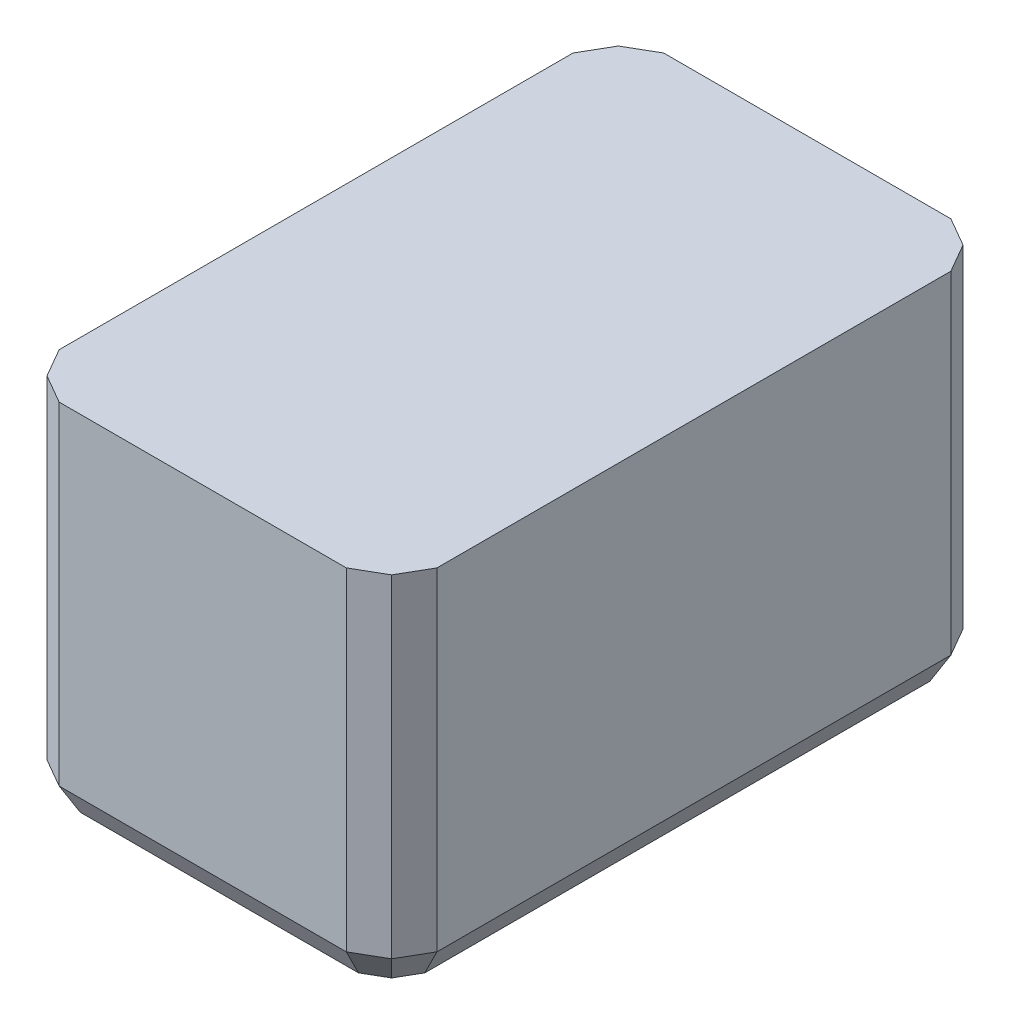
ISO-10303-21;
HEADER;
FILE_DESCRIPTION(('STEP AP214'),'2;1');
FILE_NAME('part.step','',(''),(''),'','','');
FILE_SCHEMA(('AUTOMOTIVE_DESIGN { 1 0 10303 214 1 1 1 1 }'));
ENDSEC;
DATA;
#1=APPLICATION_CONTEXT('core data for automotive mechanical design processes');
#2=APPLICATION_PROTOCOL_DEFINITION('international standard','automotive_design',2000,#1);
#3=PRODUCT_CONTEXT('',#1,'mechanical');
#4=PRODUCT('Part','Part','',(#3));
#5=PRODUCT_RELATED_PRODUCT_CATEGORY('part','',(#4));
#6=PRODUCT_DEFINITION_FORMATION('','',#4);
#7=PRODUCT_DEFINITION_CONTEXT('part definition',#1,'design');
#8=PRODUCT_DEFINITION('design','',#6,#7);
#9=PRODUCT_DEFINITION_SHAPE('','',#8);
#10=(LENGTH_UNIT() NAMED_UNIT(*) SI_UNIT(.MILLI.,.METRE.));
#11=(NAMED_UNIT(*) PLANE_ANGLE_UNIT() SI_UNIT($,.RADIAN.));
#12=(NAMED_UNIT(*) SI_UNIT($,.STERADIAN.) SOLID_ANGLE_UNIT());
#13=UNCERTAINTY_MEASURE_WITH_UNIT(LENGTH_MEASURE(1.E-05),#10,'distance_accuracy_value','');
#14=(GEOMETRIC_REPRESENTATION_CONTEXT(3) GLOBAL_UNCERTAINTY_ASSIGNED_CONTEXT((#13)) GLOBAL_UNIT_ASSIGNED_CONTEXT((#10,
#11,#12)) REPRESENTATION_CONTEXT('',''));
#15=CARTESIAN_POINT('',(0.,0.,0.));
#16=DIRECTION('',(0.,0.,1.));
#17=DIRECTION('',(1.,0.,0.));
#18=AXIS2_PLACEMENT_3D('',#15,#16,#17);
#19=CARTESIAN_POINT('',(-228.038475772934,500.,-378.038475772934));
#20=DIRECTION('',(0.866025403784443,0.,0.499999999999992));
#21=DIRECTION('',(0.499999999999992,0.,-0.866025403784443));
#22=AXIS2_PLACEMENT_3D('',#19,#20,#21);
#23=PLANE('',#22);
#24=DIRECTION('',(0.499999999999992,0.,-0.866025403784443));
#25=VECTOR('',#24,1.);
#26=CARTESIAN_POINT('',(-250.,60.0000000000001,-340.));
#27=LINE('',#26,#25);
#28=CARTESIAN_POINT('',(-250.,60.0000000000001,-340.));
#29=VERTEX_POINT('',#28);
#30=CARTESIAN_POINT('',(-228.038475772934,60.0000000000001,-378.038475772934));
#31=VERTEX_POINT('',#30);
#32=EDGE_CURVE('E308',#29,#31,#27,.T.);
#33=ORIENTED_EDGE('',*,*,#32,.F.);
#34=DIRECTION('',(0.,-1.,0.));
#35=VECTOR('',#34,1.);
#36=CARTESIAN_POINT('',(-250.,500.,-340.));
#37=LINE('',#36,#35);
#38=CARTESIAN_POINT('',(-250.,500.,-340.));
#39=VERTEX_POINT('',#38);
#40=EDGE_CURVE('E12',#39,#29,#37,.T.);
#41=ORIENTED_EDGE('',*,*,#40,.F.);
#42=DIRECTION('',(-0.499999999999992,0.,0.866025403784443));
#43=VECTOR('',#42,1.);
#44=CARTESIAN_POINT('',(-228.038475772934,500.,-378.038475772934));
#45=LINE('',#44,#43);
#46=CARTESIAN_POINT('',(-228.038475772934,500.,-378.038475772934));
#47=VERTEX_POINT('',#46);
#48=EDGE_CURVE('E636',#47,#39,#45,.T.);
#49=ORIENTED_EDGE('',*,*,#48,.F.);
#50=DIRECTION('',(0.,-1.,0.));
#51=VECTOR('',#50,1.);
#52=CARTESIAN_POINT('',(-228.038475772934,500.,-378.038475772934));
#53=LINE('',#52,#51);
#54=EDGE_CURVE('E491',#47,#31,#53,.T.);
#55=ORIENTED_EDGE('',*,*,#54,.T.);
#56=EDGE_LOOP('',(#33,#41,#49,#55));
#57=FACE_BOUND('',#56,.T.);
#58=ADVANCED_FACE('F42',(#57),#23,.F.);
#59=CARTESIAN_POINT('',(-250.,500.,340.));
#60=DIRECTION('',(0.866025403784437,0.,-0.500000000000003));
#61=DIRECTION('',(-0.500000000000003,0.,-0.866025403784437));
#62=AXIS2_PLACEMENT_3D('',#59,#60,#61);
#63=PLANE('',#62);
#64=DIRECTION('',(-0.500000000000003,0.,-0.866025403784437));
#65=VECTOR('',#64,1.);
#66=CARTESIAN_POINT('',(-228.038475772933,60.0000000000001,378.038475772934));
#67=LINE('',#66,#65);
#68=CARTESIAN_POINT('',(-228.038475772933,60.0000000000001,378.038475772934));
#69=VERTEX_POINT('',#68);
#70=CARTESIAN_POINT('',(-250.,60.0000000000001,340.));
#71=VERTEX_POINT('',#70);
#72=EDGE_CURVE('E278',#69,#71,#67,.T.);
#73=ORIENTED_EDGE('',*,*,#72,.F.);
#74=DIRECTION('',(0.,-1.,0.));
#75=VECTOR('',#74,1.);
#76=CARTESIAN_POINT('',(-228.038475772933,500.,378.038475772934));
#77=LINE('',#76,#75);
#78=CARTESIAN_POINT('',(-228.038475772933,500.,378.038475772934));
#79=VERTEX_POINT('',#78);
#80=EDGE_CURVE('E267',#79,#69,#77,.T.);
#81=ORIENTED_EDGE('',*,*,#80,.F.);
#82=DIRECTION('',(0.500000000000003,0.,0.866025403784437));
#83=VECTOR('',#82,1.);
#84=CARTESIAN_POINT('',(-250.,500.,340.));
#85=LINE('',#84,#83);
#86=CARTESIAN_POINT('',(-250.,500.,340.));
#87=VERTEX_POINT('',#86);
#88=EDGE_CURVE('E279',#87,#79,#85,.T.);
#89=ORIENTED_EDGE('',*,*,#88,.F.);
#90=DIRECTION('',(0.,-1.,0.));
#91=VECTOR('',#90,1.);
#92=CARTESIAN_POINT('',(-250.,500.,340.));
#93=LINE('',#92,#91);
#94=EDGE_CURVE('E51',#87,#71,#93,.T.);
#95=ORIENTED_EDGE('',*,*,#94,.T.);
#96=EDGE_LOOP('',(#73,#81,#89,#95));
#97=FACE_BOUND('',#96,.T.);
#98=ADVANCED_FACE('F275',(#97),#63,.F.);
#99=CARTESIAN_POINT('',(-190.,500.,400.));
#100=DIRECTION('',(0.,0.,-1.));
#101=DIRECTION('',(-1.,0.,0.));
#102=AXIS2_PLACEMENT_3D('',#99,#100,#101);
#103=PLANE('',#102);
#104=DIRECTION('',(-1.,0.,0.));
#105=VECTOR('',#104,1.);
#106=CARTESIAN_POINT('',(190.,60.0000000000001,400.));
#107=LINE('',#106,#105);
#108=CARTESIAN_POINT('',(190.,60.0000000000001,400.));
#109=VERTEX_POINT('',#108);
#110=CARTESIAN_POINT('',(-190.,60.0000000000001,400.));
#111=VERTEX_POINT('',#110);
#112=EDGE_CURVE('E573',#109,#111,#107,.T.);
#113=ORIENTED_EDGE('',*,*,#112,.F.);
#114=DIRECTION('',(0.,-1.,0.));
#115=VECTOR('',#114,1.);
#116=CARTESIAN_POINT('',(190.,500.,400.));
#117=LINE('',#116,#115);
#118=CARTESIAN_POINT('',(190.,500.,400.));
#119=VERTEX_POINT('',#118);
#120=EDGE_CURVE('E261',#119,#109,#117,.T.);
#121=ORIENTED_EDGE('',*,*,#120,.F.);
#122=DIRECTION('',(1.,0.,0.));
#123=VECTOR('',#122,1.);
#124=CARTESIAN_POINT('',(-190.,500.,400.));
#125=LINE('',#124,#123);
#126=CARTESIAN_POINT('',(-190.,500.,400.));
#127=VERTEX_POINT('',#126);
#128=EDGE_CURVE('E627',#127,#119,#125,.T.);
#129=ORIENTED_EDGE('',*,*,#128,.F.);
#130=DIRECTION('',(0.,-1.,0.));
#131=VECTOR('',#130,1.);
#132=CARTESIAN_POINT('',(-190.,500.,400.));
#133=LINE('',#132,#131);
#134=EDGE_CURVE('E264',#127,#111,#133,.T.);
#135=ORIENTED_EDGE('',*,*,#134,.T.);
#136=EDGE_LOOP('',(#113,#121,#129,#135));
#137=FACE_BOUND('',#136,.T.);
#138=ADVANCED_FACE('F486',(#137),#103,.F.);
#139=CARTESIAN_POINT('',(228.038475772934,500.,378.038475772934));
#140=DIRECTION('',(-0.866025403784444,0.,-0.49999999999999));
#141=DIRECTION('',(-0.49999999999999,0.,0.866025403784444));
#142=AXIS2_PLACEMENT_3D('',#139,#140,#141);
#143=PLANE('',#142);
#144=DIRECTION('',(-0.49999999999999,0.,0.866025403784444));
#145=VECTOR('',#144,1.);
#146=CARTESIAN_POINT('',(250.,60.0000000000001,340.));
#147=LINE('',#146,#145);
#148=CARTESIAN_POINT('',(250.,60.0000000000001,340.));
#149=VERTEX_POINT('',#148);
#150=CARTESIAN_POINT('',(228.038475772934,60.0000000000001,378.038475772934));
#151=VERTEX_POINT('',#150);
#152=EDGE_CURVE('E550',#149,#151,#147,.T.);
#153=ORIENTED_EDGE('',*,*,#152,.F.);
#154=DIRECTION('',(0.,-1.,0.));
#155=VECTOR('',#154,1.);
#156=CARTESIAN_POINT('',(250.,500.,340.));
#157=LINE('',#156,#155);
#158=CARTESIAN_POINT('',(250.,500.,340.));
#159=VERTEX_POINT('',#158);
#160=EDGE_CURVE('E240',#159,#149,#157,.T.);
#161=ORIENTED_EDGE('',*,*,#160,.F.);
#162=DIRECTION('',(0.49999999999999,0.,-0.866025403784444));
#163=VECTOR('',#162,1.);
#164=CARTESIAN_POINT('',(228.038475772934,500.,378.038475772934));
#165=LINE('',#164,#163);
#166=CARTESIAN_POINT('',(228.038475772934,500.,378.038475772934));
#167=VERTEX_POINT('',#166);
#168=EDGE_CURVE('E621',#167,#159,#165,.T.);
#169=ORIENTED_EDGE('',*,*,#168,.F.);
#170=DIRECTION('',(0.,-1.,0.));
#171=VECTOR('',#170,1.);
#172=CARTESIAN_POINT('',(228.038475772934,500.,378.038475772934));
#173=LINE('',#172,#171);
#174=EDGE_CURVE('E246',#167,#151,#173,.T.);
#175=ORIENTED_EDGE('',*,*,#174,.T.);
#176=EDGE_LOOP('',(#153,#161,#169,#175));
#177=FACE_BOUND('',#176,.T.);
#178=ADVANCED_FACE('F620',(#177),#143,.F.);
#179=CARTESIAN_POINT('',(250.,500.,-340.));
#180=DIRECTION('',(-0.866025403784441,0.,0.499999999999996));
#181=DIRECTION('',(0.499999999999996,0.,0.866025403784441));
#182=AXIS2_PLACEMENT_3D('',#179,#180,#181);
#183=PLANE('',#182);
#184=DIRECTION('',(0.499999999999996,0.,0.866025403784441));
#185=VECTOR('',#184,1.);
#186=CARTESIAN_POINT('',(228.038475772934,60.,-378.038475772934));
#187=LINE('',#186,#185);
#188=CARTESIAN_POINT('',(228.038475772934,60.,-378.038475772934));
#189=VERTEX_POINT('',#188);
#190=CARTESIAN_POINT('',(250.,60.0000000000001,-340.));
#191=VERTEX_POINT('',#190);
#192=EDGE_CURVE('E223',#189,#191,#187,.T.);
#193=ORIENTED_EDGE('',*,*,#192,.F.);
#194=DIRECTION('',(0.,-1.,0.));
#195=VECTOR('',#194,1.);
#196=CARTESIAN_POINT('',(228.038475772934,500.,-378.038475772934));
#197=LINE('',#196,#195);
#198=CARTESIAN_POINT('',(228.038475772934,500.,-378.038475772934));
#199=VERTEX_POINT('',#198);
#200=EDGE_CURVE('E245',#199,#189,#197,.T.);
#201=ORIENTED_EDGE('',*,*,#200,.F.);
#202=DIRECTION('',(-0.499999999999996,0.,-0.866025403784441));
#203=VECTOR('',#202,1.);
#204=CARTESIAN_POINT('',(250.,500.,-340.));
#205=LINE('',#204,#203);
#206=CARTESIAN_POINT('',(250.,500.,-340.));
#207=VERTEX_POINT('',#206);
#208=EDGE_CURVE('E244',#207,#199,#205,.T.);
#209=ORIENTED_EDGE('',*,*,#208,.F.);
#210=DIRECTION('',(0.,-1.,0.));
#211=VECTOR('',#210,1.);
#212=CARTESIAN_POINT('',(250.,500.,-340.));
#213=LINE('',#212,#211);
#214=EDGE_CURVE('E45',#207,#191,#213,.T.);
#215=ORIENTED_EDGE('',*,*,#214,.T.);
#216=EDGE_LOOP('',(#193,#201,#209,#215));
#217=FACE_BOUND('',#216,.T.);
#218=ADVANCED_FACE('F243',(#217),#183,.F.);
#219=CARTESIAN_POINT('',(190.,500.,-400.));
#220=DIRECTION('',(0.,0.,1.));
#221=DIRECTION('',(1.,0.,0.));
#222=AXIS2_PLACEMENT_3D('',#219,#220,#221);
#223=PLANE('',#222);
#224=DIRECTION('',(1.,0.,0.));
#225=VECTOR('',#224,1.);
#226=CARTESIAN_POINT('',(-190.,60.,-400.));
#227=LINE('',#226,#225);
#228=CARTESIAN_POINT('',(-190.,60.,-400.));
#229=VERTEX_POINT('',#228);
#230=CARTESIAN_POINT('',(190.,60.,-400.));
#231=VERTEX_POINT('',#230);
#232=EDGE_CURVE('E324',#229,#231,#227,.T.);
#233=ORIENTED_EDGE('',*,*,#232,.F.);
#234=DIRECTION('',(0.,-1.,0.));
#235=VECTOR('',#234,1.);
#236=CARTESIAN_POINT('',(-190.,500.,-400.));
#237=LINE('',#236,#235);
#238=CARTESIAN_POINT('',(-190.,500.,-400.));
#239=VERTEX_POINT('',#238);
#240=EDGE_CURVE('E254',#239,#229,#237,.T.);
#241=ORIENTED_EDGE('',*,*,#240,.F.);
#242=DIRECTION('',(-1.,0.,0.));
#243=VECTOR('',#242,1.);
#244=CARTESIAN_POINT('',(190.,500.,-400.));
#245=LINE('',#244,#243);
#246=CARTESIAN_POINT('',(190.,500.,-400.));
#247=VERTEX_POINT('',#246);
#248=EDGE_CURVE('E507',#247,#239,#245,.T.);
#249=ORIENTED_EDGE('',*,*,#248,.F.);
#250=DIRECTION('',(0.,-1.,0.));
#251=VECTOR('',#250,1.);
#252=CARTESIAN_POINT('',(190.,500.,-400.));
#253=LINE('',#252,#251);
#254=EDGE_CURVE('E248',#247,#231,#253,.T.);
#255=ORIENTED_EDGE('',*,*,#254,.T.);
#256=EDGE_LOOP('',(#233,#241,#249,#255));
#257=FACE_BOUND('',#256,.T.);
#258=ADVANCED_FACE('F504',(#257),#223,.F.);
#259=CARTESIAN_POINT('',(-250.,500.,-340.));
#260=DIRECTION('',(1.,0.,0.));
#261=DIRECTION('',(0.,0.,-1.));
#262=AXIS2_PLACEMENT_3D('',#259,#260,#261);
#263=PLANE('',#262);
#264=ORIENTED_EDGE('',*,*,#40,.T.);
#265=DIRECTION('',(0.,0.,-1.));
#266=VECTOR('',#265,1.);
#267=CARTESIAN_POINT('',(-250.,60.0000000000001,340.));
#268=LINE('',#267,#266);
#269=EDGE_CURVE('E286',#71,#29,#268,.T.);
#270=ORIENTED_EDGE('',*,*,#269,.F.);
#271=ORIENTED_EDGE('',*,*,#94,.F.);
#272=DIRECTION('',(0.,0.,1.));
#273=VECTOR('',#272,1.);
#274=CARTESIAN_POINT('',(-250.,500.,-340.));
#275=LINE('',#274,#273);
#276=EDGE_CURVE('E283',#39,#87,#275,.T.);
#277=ORIENTED_EDGE('',*,*,#276,.F.);
#278=EDGE_LOOP('',(#264,#270,#271,#277));
#279=FACE_BOUND('',#278,.T.);
#280=ADVANCED_FACE('F282',(#279),#263,.F.);
#281=CARTESIAN_POINT('',(-228.038475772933,500.,378.038475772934));
#282=DIRECTION('',(0.499999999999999,0.,-0.866025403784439));
#283=DIRECTION('',(-0.866025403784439,0.,-0.499999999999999));
#284=AXIS2_PLACEMENT_3D('',#281,#282,#283);
#285=PLANE('',#284);
#286=ORIENTED_EDGE('',*,*,#80,.T.);
#287=DIRECTION('',(-0.866025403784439,0.,-0.499999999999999));
#288=VECTOR('',#287,1.);
#289=CARTESIAN_POINT('',(-190.,60.0000000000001,400.));
#290=LINE('',#289,#288);
#291=EDGE_CURVE('E580',#111,#69,#290,.T.);
#292=ORIENTED_EDGE('',*,*,#291,.F.);
#293=ORIENTED_EDGE('',*,*,#134,.F.);
#294=DIRECTION('',(0.866025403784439,0.,0.499999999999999));
#295=VECTOR('',#294,1.);
#296=CARTESIAN_POINT('',(-228.038475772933,500.,378.038475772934));
#297=LINE('',#296,#295);
#298=EDGE_CURVE('E643',#79,#127,#297,.T.);
#299=ORIENTED_EDGE('',*,*,#298,.F.);
#300=EDGE_LOOP('',(#286,#292,#293,#299));
#301=FACE_BOUND('',#300,.T.);
#302=ADVANCED_FACE('F649',(#301),#285,.F.);
#303=CARTESIAN_POINT('',(190.,500.,400.));
#304=DIRECTION('',(-0.499999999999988,0.,-0.866025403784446));
#305=DIRECTION('',(-0.866025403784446,0.,0.499999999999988));
#306=AXIS2_PLACEMENT_3D('',#303,#304,#305);
#307=PLANE('',#306);
#308=ORIENTED_EDGE('',*,*,#120,.T.);
#309=DIRECTION('',(-0.866025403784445,0.,0.499999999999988));
#310=VECTOR('',#309,1.);
#311=CARTESIAN_POINT('',(228.038475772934,60.0000000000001,378.038475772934));
#312=LINE('',#311,#310);
#313=EDGE_CURVE('E561',#151,#109,#312,.T.);
#314=ORIENTED_EDGE('',*,*,#313,.F.);
#315=ORIENTED_EDGE('',*,*,#174,.F.);
#316=DIRECTION('',(0.866025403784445,0.,-0.499999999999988));
#317=VECTOR('',#316,1.);
#318=CARTESIAN_POINT('',(190.,500.,400.));
#319=LINE('',#318,#317);
#320=EDGE_CURVE('E624',#119,#167,#319,.T.);
#321=ORIENTED_EDGE('',*,*,#320,.F.);
#322=EDGE_LOOP('',(#308,#314,#315,#321));
#323=FACE_BOUND('',#322,.T.);
#324=ADVANCED_FACE('F616',(#323),#307,.F.);
#325=CARTESIAN_POINT('',(250.,500.,340.));
#326=DIRECTION('',(-1.,0.,0.));
#327=DIRECTION('',(0.,0.,1.));
#328=AXIS2_PLACEMENT_3D('',#325,#326,#327);
#329=PLANE('',#328);
#330=ORIENTED_EDGE('',*,*,#160,.T.);
#331=DIRECTION('',(0.,0.,-1.));
#332=VECTOR('',#331,1.);
#333=CARTESIAN_POINT('',(250.,60.0000000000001,509.705627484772));
#334=LINE('',#333,#332);
#335=EDGE_CURVE('E212',#149,#191,#334,.T.);
#336=ORIENTED_EDGE('',*,*,#335,.T.);
#337=ORIENTED_EDGE('',*,*,#214,.F.);
#338=DIRECTION('',(0.,0.,-1.));
#339=VECTOR('',#338,1.);
#340=CARTESIAN_POINT('',(250.,500.,340.));
#341=LINE('',#340,#339);
#342=EDGE_CURVE('E623',#159,#207,#341,.T.);
#343=ORIENTED_EDGE('',*,*,#342,.F.);
#344=EDGE_LOOP('',(#330,#336,#337,#343));
#345=FACE_BOUND('',#344,.T.);
#346=ADVANCED_FACE('F236',(#345),#329,.F.);
#347=CARTESIAN_POINT('',(228.038475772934,500.,-378.038475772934));
#348=DIRECTION('',(-0.499999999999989,0.,0.866025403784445));
#349=DIRECTION('',(0.866025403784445,0.,0.499999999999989));
#350=AXIS2_PLACEMENT_3D('',#347,#348,#349);
#351=PLANE('',#350);
#352=ORIENTED_EDGE('',*,*,#200,.T.);
#353=DIRECTION('',(0.866025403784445,0.,0.499999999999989));
#354=VECTOR('',#353,1.);
#355=CARTESIAN_POINT('',(190.,60.,-400.));
#356=LINE('',#355,#354);
#357=EDGE_CURVE('E337',#231,#189,#356,.T.);
#358=ORIENTED_EDGE('',*,*,#357,.F.);
#359=ORIENTED_EDGE('',*,*,#254,.F.);
#360=DIRECTION('',(-0.866025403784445,0.,-0.499999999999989));
#361=VECTOR('',#360,1.);
#362=CARTESIAN_POINT('',(228.038475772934,500.,-378.038475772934));
#363=LINE('',#362,#361);
#364=EDGE_CURVE('E509',#199,#247,#363,.T.);
#365=ORIENTED_EDGE('',*,*,#364,.F.);
#366=EDGE_LOOP('',(#352,#358,#359,#365));
#367=FACE_BOUND('',#366,.T.);
#368=ADVANCED_FACE('F508',(#367),#351,.F.);
#369=CARTESIAN_POINT('',(-190.,500.,-400.));
#370=DIRECTION('',(0.499999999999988,0.,0.866025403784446));
#371=DIRECTION('',(0.866025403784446,0.,-0.499999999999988));
#372=AXIS2_PLACEMENT_3D('',#369,#370,#371);
#373=PLANE('',#372);
#374=ORIENTED_EDGE('',*,*,#240,.T.);
#375=DIRECTION('',(0.866025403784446,0.,-0.499999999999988));
#376=VECTOR('',#375,1.);
#377=CARTESIAN_POINT('',(-228.038475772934,60.,-378.038475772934));
#378=LINE('',#377,#376);
#379=EDGE_CURVE('E318',#31,#229,#378,.T.);
#380=ORIENTED_EDGE('',*,*,#379,.F.);
#381=ORIENTED_EDGE('',*,*,#54,.F.);
#382=DIRECTION('',(-0.866025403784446,0.,0.499999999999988));
#383=VECTOR('',#382,1.);
#384=CARTESIAN_POINT('',(-190.,500.,-400.));
#385=LINE('',#384,#383);
#386=EDGE_CURVE('E634',#239,#47,#385,.T.);
#387=ORIENTED_EDGE('',*,*,#386,.F.);
#388=EDGE_LOOP('',(#374,#380,#381,#387));
#389=FACE_BOUND('',#388,.T.);
#390=ADVANCED_FACE('F496',(#389),#373,.F.);
#391=CARTESIAN_POINT('',(-114.019237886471,500.,-575.525588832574));
#392=DIRECTION('',(0.,-1.,0.));
#393=DIRECTION('',(0.,0.,-1.));
#394=AXIS2_PLACEMENT_3D('',#391,#392,#393);
#395=PLANE('',#394);
#396=ORIENTED_EDGE('',*,*,#48,.T.);
#397=ORIENTED_EDGE('',*,*,#276,.T.);
#398=ORIENTED_EDGE('',*,*,#88,.T.);
#399=ORIENTED_EDGE('',*,*,#298,.T.);
#400=ORIENTED_EDGE('',*,*,#128,.T.);
#401=ORIENTED_EDGE('',*,*,#320,.T.);
#402=ORIENTED_EDGE('',*,*,#168,.T.);
#403=ORIENTED_EDGE('',*,*,#342,.T.);
#404=ORIENTED_EDGE('',*,*,#208,.T.);
#405=ORIENTED_EDGE('',*,*,#364,.T.);
#406=ORIENTED_EDGE('',*,*,#248,.T.);
#407=ORIENTED_EDGE('',*,*,#386,.T.);
#408=EDGE_LOOP('',(#396,#397,#398,#399,#400,#401,#402,#403,#404,#405,#406,#407));
#409=FACE_BOUND('',#408,.T.);
#410=ADVANCED_FACE('F366',(#409),#395,.F.);
#411=CARTESIAN_POINT('',(69.4520422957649,-90.4321606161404,-219.452042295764));
#412=DIRECTION('',(0.433012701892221,-0.866025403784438,-0.249999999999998));
#413=DIRECTION('',(0.894427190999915,0.44721359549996,0.));
#414=AXIS2_PLACEMENT_3D('',#411,#412,#413);
#415=PLANE('',#414);
#416=CARTESIAN_POINT('',(228.038475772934,21.9615242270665,-334.115427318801));
#417=DIRECTION('',(-0.843610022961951,-0.48705847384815,0.226044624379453));
#418=VECTOR('',#417,1.);
#419=LINE('',#416,#418);
#420=CARTESIAN_POINT('',(228.038475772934,21.9615242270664,-334.115427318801));
#421=VERTEX_POINT('',#420);
#422=CARTESIAN_POINT('',(190.,0.,-323.923048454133));
#423=VERTEX_POINT('',#422);
#424=EDGE_CURVE('E217',#421,#423,#419,.T.);
#425=ORIENTED_EDGE('',*,*,#424,.T.);
#426=DIRECTION('',(0.499999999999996,0.,0.866025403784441));
#427=VECTOR('',#426,1.);
#428=CARTESIAN_POINT('',(184.115427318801,0.,-334.115427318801));
#429=LINE('',#428,#427);
#430=CARTESIAN_POINT('',(184.115427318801,0.,-334.115427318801));
#431=VERTEX_POINT('',#430);
#432=EDGE_CURVE('E218',#431,#423,#429,.T.);
#433=ORIENTED_EDGE('',*,*,#432,.F.);
#434=DIRECTION('',(0.617565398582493,0.487058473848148,-0.617565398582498));
#435=VECTOR('',#434,1.);
#436=CARTESIAN_POINT('',(69.4520422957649,-90.4321606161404,-219.452042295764));
#437=LINE('',#436,#435);
#438=CARTESIAN_POINT('',(211.961524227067,21.9615242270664,-361.961524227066));
#439=VERTEX_POINT('',#438);
#440=EDGE_CURVE('E345',#431,#439,#437,.T.);
#441=ORIENTED_EDGE('',*,*,#440,.T.);
#442=DIRECTION('',(0.499999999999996,0.,0.866025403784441));
#443=VECTOR('',#442,1.);
#444=CARTESIAN_POINT('',(211.961524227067,21.9615242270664,-361.961524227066));
#445=LINE('',#444,#443);
#446=EDGE_CURVE('E231',#439,#421,#445,.T.);
#447=ORIENTED_EDGE('',*,*,#446,.T.);
#448=EDGE_LOOP('',(#425,#433,#441,#447));
#449=FACE_BOUND('',#448,.T.);
#450=ADVANCED_FACE('F356',(#449),#415,.T.);
#451=CARTESIAN_POINT('',(160.895149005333,-98.8628168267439,-310.895149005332));
#452=DIRECTION('',(0.750000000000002,-0.500000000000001,-0.433012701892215));
#453=DIRECTION('',(0.554700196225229,0.832050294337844,0.));
#454=AXIS2_PLACEMENT_3D('',#451,#452,#453);
#455=PLANE('',#454);
#456=CARTESIAN_POINT('',(250.,60.,-340.));
#457=DIRECTION('',(-0.495572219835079,-0.858356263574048,0.132788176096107));
#458=VECTOR('',#457,1.);
#459=LINE('',#456,#458);
#460=EDGE_CURVE('E206',#191,#421,#459,.T.);
#461=ORIENTED_EDGE('',*,*,#460,.T.);
#462=ORIENTED_EDGE('',*,*,#446,.F.);
#463=DIRECTION('',(0.36278404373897,0.858356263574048,-0.362784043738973));
#464=VECTOR('',#463,1.);
#465=CARTESIAN_POINT('',(160.895149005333,-98.8628168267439,-310.895149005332));
#466=LINE('',#465,#464);
#467=EDGE_CURVE('E226',#439,#189,#466,.T.);
#468=ORIENTED_EDGE('',*,*,#467,.T.);
#469=ORIENTED_EDGE('',*,*,#192,.T.);
#470=EDGE_LOOP('',(#461,#462,#468,#469));
#471=FACE_BOUND('',#470,.T.);
#472=ADVANCED_FACE('F224',(#471),#455,.T.);
#473=CARTESIAN_POINT('',(165.328259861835,-99.4806352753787,-307.923812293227));
#474=DIRECTION('',(-0.43301270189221,0.500000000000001,0.750000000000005));
#475=DIRECTION('',(0.,-0.832050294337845,0.554700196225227));
#476=AXIS2_PLACEMENT_3D('',#473,#474,#475);
#477=PLANE('',#476);
#478=DIRECTION('',(0.866025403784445,0.,0.499999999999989));
#479=VECTOR('',#478,1.);
#480=CARTESIAN_POINT('',(184.115427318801,21.9615242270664,-378.038475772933));
#481=LINE('',#480,#479);
#482=CARTESIAN_POINT('',(184.115427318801,21.9615242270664,-378.038475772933));
#483=VERTEX_POINT('',#482);
#484=EDGE_CURVE('E342',#483,#439,#481,.T.);
#485=ORIENTED_EDGE('',*,*,#484,.F.);
#486=DIRECTION('',(-0.132788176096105,-0.858356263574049,0.495572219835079));
#487=VECTOR('',#486,1.);
#488=CARTESIAN_POINT('',(165.328259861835,-99.4806352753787,-307.923812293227));
#489=LINE('',#488,#487);
#490=EDGE_CURVE('E333',#231,#483,#489,.T.);
#491=ORIENTED_EDGE('',*,*,#490,.F.);
#492=ORIENTED_EDGE('',*,*,#357,.T.);
#493=ORIENTED_EDGE('',*,*,#467,.F.);
#494=EDGE_LOOP('',(#485,#491,#492,#493));
#495=FACE_BOUND('',#494,.T.);
#496=ADVANCED_FACE('F372',(#495),#477,.F.);
#497=CARTESIAN_POINT('',(127.84597028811,-99.2823051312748,-168.038003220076));
#498=DIRECTION('',(-0.249999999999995,0.866025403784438,0.433012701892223));
#499=DIRECTION('',(0.,-0.447213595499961,0.894427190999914));
#500=AXIS2_PLACEMENT_3D('',#497,#498,#499);
#501=PLANE('',#500);
#502=DIRECTION('',(0.866025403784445,0.,0.499999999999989));
#503=VECTOR('',#502,1.);
#504=CARTESIAN_POINT('',(173.923048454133,0.,-340.));
#505=LINE('',#504,#503);
#506=CARTESIAN_POINT('',(173.923048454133,0.,-340.));
#507=VERTEX_POINT('',#506);
#508=EDGE_CURVE('E339',#507,#431,#505,.T.);
#509=ORIENTED_EDGE('',*,*,#508,.F.);
#510=DIRECTION('',(-0.22604462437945,-0.48705847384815,0.843610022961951));
#511=VECTOR('',#510,1.);
#512=CARTESIAN_POINT('',(127.84597028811,-99.2823051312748,-168.038003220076));
#513=LINE('',#512,#511);
#514=EDGE_CURVE('E334',#483,#507,#513,.T.);
#515=ORIENTED_EDGE('',*,*,#514,.F.);
#516=ORIENTED_EDGE('',*,*,#484,.T.);
#517=ORIENTED_EDGE('',*,*,#440,.F.);
#518=EDGE_LOOP('',(#509,#515,#516,#517));
#519=FACE_BOUND('',#518,.T.);
#520=ADVANCED_FACE('F367',(#519),#501,.F.);
#521=CARTESIAN_POINT('',(-171.37175318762,-60.4148803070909,-330.478436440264));
#522=DIRECTION('',(0.,-0.500000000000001,-0.866025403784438));
#523=DIRECTION('',(0.,0.866025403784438,-0.500000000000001));
#524=AXIS2_PLACEMENT_3D('',#521,#522,#523);
#525=PLANE('',#524);
#526=ORIENTED_EDGE('',*,*,#490,.T.);
#527=DIRECTION('',(1.,0.,0.));
#528=VECTOR('',#527,1.);
#529=CARTESIAN_POINT('',(-184.115427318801,21.9615242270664,-378.038475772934));
#530=LINE('',#529,#528);
#531=CARTESIAN_POINT('',(-184.115427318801,21.9615242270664,-378.038475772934));
#532=VERTEX_POINT('',#531);
#533=EDGE_CURVE('E330',#532,#483,#530,.T.);
#534=ORIENTED_EDGE('',*,*,#533,.F.);
#535=DIRECTION('',(-0.132788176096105,0.858356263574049,-0.495572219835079));
#536=VECTOR('',#535,1.);
#537=CARTESIAN_POINT('',(-171.37175318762,-60.4148803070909,-330.478436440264));
#538=LINE('',#537,#536);
#539=EDGE_CURVE('E320',#532,#229,#538,.T.);
#540=ORIENTED_EDGE('',*,*,#539,.T.);
#541=ORIENTED_EDGE('',*,*,#232,.T.);
#542=EDGE_LOOP('',(#526,#534,#540,#541));
#543=FACE_BOUND('',#542,.T.);
#544=ADVANCED_FACE('F469',(#543),#525,.T.);
#545=CARTESIAN_POINT('',(-142.397950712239,-67.9271450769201,-222.346733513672));
#546=DIRECTION('',(0.,-0.866025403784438,-0.500000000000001));
#547=DIRECTION('',(0.,0.500000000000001,-0.866025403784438));
#548=AXIS2_PLACEMENT_3D('',#545,#546,#547);
#549=PLANE('',#548);
#550=ORIENTED_EDGE('',*,*,#514,.T.);
#551=DIRECTION('',(1.,0.,0.));
#552=VECTOR('',#551,1.);
#553=CARTESIAN_POINT('',(-173.923048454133,0.,-340.));
#554=LINE('',#553,#552);
#555=CARTESIAN_POINT('',(-173.923048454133,0.,-340.));
#556=VERTEX_POINT('',#555);
#557=EDGE_CURVE('E327',#556,#507,#554,.T.);
#558=ORIENTED_EDGE('',*,*,#557,.F.);
#559=DIRECTION('',(-0.226044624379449,0.48705847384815,-0.843610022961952));
#560=VECTOR('',#559,1.);
#561=CARTESIAN_POINT('',(-142.397950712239,-67.9271450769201,-222.346733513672));
#562=LINE('',#561,#560);
#563=EDGE_CURVE('E323',#556,#532,#562,.T.);
#564=ORIENTED_EDGE('',*,*,#563,.T.);
#565=ORIENTED_EDGE('',*,*,#533,.T.);
#566=EDGE_LOOP('',(#550,#558,#564,#565));
#567=FACE_BOUND('',#566,.T.);
#568=ADVANCED_FACE('F465',(#567),#549,.T.);
#569=CARTESIAN_POINT('',(-90.0137265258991,-74.2156715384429,-240.013726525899));
#570=DIRECTION('',(0.249999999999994,0.866025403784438,0.433012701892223));
#571=DIRECTION('',(0.,-0.447213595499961,0.894427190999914));
#572=AXIS2_PLACEMENT_3D('',#569,#570,#571);
#573=PLANE('',#572);
#574=DIRECTION('',(0.866025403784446,0.,-0.499999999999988));
#575=VECTOR('',#574,1.);
#576=CARTESIAN_POINT('',(-184.115427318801,0.,-334.115427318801));
#577=LINE('',#576,#575);
#578=CARTESIAN_POINT('',(-184.115427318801,0.,-334.115427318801));
#579=VERTEX_POINT('',#578);
#580=EDGE_CURVE('E312',#579,#556,#577,.T.);
#581=ORIENTED_EDGE('',*,*,#580,.F.);
#582=DIRECTION('',(0.617565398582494,-0.487058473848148,0.617565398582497));
#583=VECTOR('',#582,1.);
#584=CARTESIAN_POINT('',(-90.0137265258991,-74.2156715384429,-240.013726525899));
#585=LINE('',#584,#583);
#586=CARTESIAN_POINT('',(-211.961524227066,21.9615242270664,-361.961524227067));
#587=VERTEX_POINT('',#586);
#588=EDGE_CURVE('E310',#587,#579,#585,.T.);
#589=ORIENTED_EDGE('',*,*,#588,.F.);
#590=DIRECTION('',(0.866025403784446,0.,-0.499999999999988));
#591=VECTOR('',#590,1.);
#592=CARTESIAN_POINT('',(-211.961524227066,21.9615242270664,-361.961524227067));
#593=LINE('',#592,#591);
#594=EDGE_CURVE('E315',#587,#532,#593,.T.);
#595=ORIENTED_EDGE('',*,*,#594,.T.);
#596=ORIENTED_EDGE('',*,*,#563,.F.);
#597=EDGE_LOOP('',(#581,#589,#595,#596));
#598=FACE_BOUND('',#597,.T.);
#599=ADVANCED_FACE('F462',(#598),#573,.F.);
#600=CARTESIAN_POINT('',(-177.478049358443,-59.627253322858,-327.478049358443));
#601=DIRECTION('',(0.433012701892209,0.500000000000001,0.750000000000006));
#602=DIRECTION('',(0.,-0.832050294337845,0.554700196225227));
#603=AXIS2_PLACEMENT_3D('',#600,#601,#602);
#604=PLANE('',#603);
#605=ORIENTED_EDGE('',*,*,#594,.F.);
#606=DIRECTION('',(0.362784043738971,-0.858356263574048,0.362784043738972));
#607=VECTOR('',#606,1.);
#608=CARTESIAN_POINT('',(-177.478049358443,-59.627253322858,-327.478049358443));
#609=LINE('',#608,#607);
#610=EDGE_CURVE('E58',#31,#587,#609,.T.);
#611=ORIENTED_EDGE('',*,*,#610,.F.);
#612=ORIENTED_EDGE('',*,*,#379,.T.);
#613=ORIENTED_EDGE('',*,*,#539,.F.);
#614=EDGE_LOOP('',(#605,#611,#612,#613));
#615=FACE_BOUND('',#614,.T.);
#616=ADVANCED_FACE('F457',(#615),#604,.F.);
#617=CARTESIAN_POINT('',(-49.3228589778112,-81.2199852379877,-286.228722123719));
#618=DIRECTION('',(-0.433012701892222,-0.866025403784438,-0.249999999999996));
#619=DIRECTION('',(0.894427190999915,-0.447213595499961,0.));
#620=AXIS2_PLACEMENT_3D('',#617,#618,#619);
#621=PLANE('',#620);
#622=ORIENTED_EDGE('',*,*,#588,.T.);
#623=DIRECTION('',(0.499999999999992,0.,-0.866025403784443));
#624=VECTOR('',#623,1.);
#625=CARTESIAN_POINT('',(-190.,0.,-323.923048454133));
#626=LINE('',#625,#624);
#627=CARTESIAN_POINT('',(-190.,0.,-323.923048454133));
#628=VERTEX_POINT('',#627);
#629=EDGE_CURVE('E302',#628,#579,#626,.T.);
#630=ORIENTED_EDGE('',*,*,#629,.F.);
#631=DIRECTION('',(-0.843610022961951,0.48705847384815,-0.226044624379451));
#632=VECTOR('',#631,1.);
#633=CARTESIAN_POINT('',(-49.3228589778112,-81.2199852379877,-286.228722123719));
#634=LINE('',#633,#632);
#635=CARTESIAN_POINT('',(-228.038475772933,21.9615242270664,-334.115427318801));
#636=VERTEX_POINT('',#635);
#637=EDGE_CURVE('E291',#628,#636,#634,.T.);
#638=ORIENTED_EDGE('',*,*,#637,.T.);
#639=DIRECTION('',(0.499999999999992,0.,-0.866025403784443));
#640=VECTOR('',#639,1.);
#641=CARTESIAN_POINT('',(-228.038475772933,21.9615242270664,-334.115427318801));
#642=LINE('',#641,#640);
#643=EDGE_CURVE('E305',#636,#587,#642,.T.);
#644=ORIENTED_EDGE('',*,*,#643,.T.);
#645=EDGE_LOOP('',(#622,#630,#638,#644));
#646=FACE_BOUND('',#645,.T.);
#647=ADVANCED_FACE('F454',(#646),#621,.T.);
#648=CARTESIAN_POINT('',(-181.404532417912,-58.8108350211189,-321.619899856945));
#649=DIRECTION('',(-0.750000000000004,-0.500000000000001,-0.433012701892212));
#650=DIRECTION('',(0.554700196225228,-0.832050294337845,0.));
#651=AXIS2_PLACEMENT_3D('',#648,#649,#650);
#652=PLANE('',#651);
#653=ORIENTED_EDGE('',*,*,#610,.T.);
#654=ORIENTED_EDGE('',*,*,#643,.F.);
#655=DIRECTION('',(-0.495572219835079,0.858356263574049,-0.132788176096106));
#656=VECTOR('',#655,1.);
#657=CARTESIAN_POINT('',(-181.404532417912,-58.8108350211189,-321.619899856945));
#658=LINE('',#657,#656);
#659=EDGE_CURVE('E295',#636,#29,#658,.T.);
#660=ORIENTED_EDGE('',*,*,#659,.T.);
#661=ORIENTED_EDGE('',*,*,#32,.T.);
#662=EDGE_LOOP('',(#653,#654,#660,#661));
#663=FACE_BOUND('',#662,.T.);
#664=ADVANCED_FACE('F450',(#663),#652,.T.);
#665=CARTESIAN_POINT('',(-170.912287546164,-11.0202959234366,318.80851131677));
#666=DIRECTION('',(0.500000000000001,0.866025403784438,0.));
#667=DIRECTION('',(-0.866025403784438,0.500000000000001,0.));
#668=AXIS2_PLACEMENT_3D('',#665,#666,#667);
#669=PLANE('',#668);
#670=DIRECTION('',(0.,0.,-1.));
#671=VECTOR('',#670,1.);
#672=CARTESIAN_POINT('',(-190.,0.,323.923048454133));
#673=LINE('',#672,#671);
#674=CARTESIAN_POINT('',(-190.,0.,323.923048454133));
#675=VERTEX_POINT('',#674);
#676=EDGE_CURVE('E298',#675,#628,#673,.T.);
#677=ORIENTED_EDGE('',*,*,#676,.F.);
#678=DIRECTION('',(0.84361002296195,-0.487058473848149,-0.226044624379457));
#679=VECTOR('',#678,1.);
#680=CARTESIAN_POINT('',(-170.912287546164,-11.0202959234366,318.80851131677));
#681=LINE('',#680,#679);
#682=CARTESIAN_POINT('',(-228.038475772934,21.9615242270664,334.115427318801));
#683=VERTEX_POINT('',#682);
#684=EDGE_CURVE('E520',#683,#675,#681,.T.);
#685=ORIENTED_EDGE('',*,*,#684,.F.);
#686=DIRECTION('',(0.,0.,-1.));
#687=VECTOR('',#686,1.);
#688=CARTESIAN_POINT('',(-228.038475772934,21.9615242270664,334.115427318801));
#689=LINE('',#688,#687);
#690=EDGE_CURVE('E292',#683,#636,#689,.T.);
#691=ORIENTED_EDGE('',*,*,#690,.T.);
#692=ORIENTED_EDGE('',*,*,#637,.F.);
#693=EDGE_LOOP('',(#677,#685,#691,#692));
#694=FACE_BOUND('',#693,.T.);
#695=ADVANCED_FACE('F447',(#694),#669,.F.);
#696=CARTESIAN_POINT('',(-225.280975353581,17.1853933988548,333.376557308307));
#697=DIRECTION('',(0.866025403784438,0.500000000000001,0.));
#698=DIRECTION('',(-0.500000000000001,0.866025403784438,0.));
#699=AXIS2_PLACEMENT_3D('',#696,#697,#698);
#700=PLANE('',#699);
#701=ORIENTED_EDGE('',*,*,#690,.F.);
#702=DIRECTION('',(0.495572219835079,-0.858356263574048,-0.132788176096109));
#703=VECTOR('',#702,1.);
#704=CARTESIAN_POINT('',(-225.280975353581,17.1853933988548,333.376557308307));
#705=LINE('',#704,#703);
#706=EDGE_CURVE('E517',#71,#683,#705,.T.);
#707=ORIENTED_EDGE('',*,*,#706,.F.);
#708=ORIENTED_EDGE('',*,*,#269,.T.);
#709=ORIENTED_EDGE('',*,*,#659,.F.);
#710=EDGE_LOOP('',(#701,#707,#708,#709));
#711=FACE_BOUND('',#710,.T.);
#712=ADVANCED_FACE('F442',(#711),#700,.F.);
#713=CARTESIAN_POINT('',(-170.381712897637,-10.8314390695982,320.381712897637));
#714=DIRECTION('',(-0.433012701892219,-0.866025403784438,0.250000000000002));
#715=DIRECTION('',(0.894427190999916,-0.447213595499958,0.));
#716=AXIS2_PLACEMENT_3D('',#713,#714,#715);
#717=PLANE('',#716);
#718=ORIENTED_EDGE('',*,*,#684,.T.);
#719=DIRECTION('',(-0.500000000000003,0.,-0.866025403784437));
#720=VECTOR('',#719,1.);
#721=CARTESIAN_POINT('',(-184.115427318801,0.,334.115427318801));
#722=LINE('',#721,#720);
#723=CARTESIAN_POINT('',(-184.115427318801,0.,334.115427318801));
#724=VERTEX_POINT('',#723);
#725=EDGE_CURVE('E526',#724,#675,#722,.T.);
#726=ORIENTED_EDGE('',*,*,#725,.F.);
#727=DIRECTION('',(-0.617565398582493,0.487058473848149,0.617565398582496));
#728=VECTOR('',#727,1.);
#729=CARTESIAN_POINT('',(-170.381712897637,-10.8314390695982,320.381712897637));
#730=LINE('',#729,#728);
#731=CARTESIAN_POINT('',(-211.961524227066,21.9615242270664,361.961524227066));
#732=VERTEX_POINT('',#731);
#733=EDGE_CURVE('E527',#724,#732,#730,.T.);
#734=ORIENTED_EDGE('',*,*,#733,.T.);
#735=DIRECTION('',(-0.500000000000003,0.,-0.866025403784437));
#736=VECTOR('',#735,1.);
#737=CARTESIAN_POINT('',(-211.961524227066,21.9615242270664,361.961524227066));
#738=LINE('',#737,#736);
#739=EDGE_CURVE('E586',#732,#683,#738,.T.);
#740=ORIENTED_EDGE('',*,*,#739,.T.);
#741=EDGE_LOOP('',(#718,#726,#734,#740));
#742=FACE_BOUND('',#741,.T.);
#743=ADVANCED_FACE('F439',(#742),#717,.T.);
#744=CARTESIAN_POINT('',(-211.474689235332,20.8096602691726,361.474689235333));
#745=DIRECTION('',(-0.749999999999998,-0.500000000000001,0.433012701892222));
#746=DIRECTION('',(0.55470019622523,-0.832050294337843,0.));
#747=AXIS2_PLACEMENT_3D('',#744,#745,#746);
#748=PLANE('',#747);
#749=ORIENTED_EDGE('',*,*,#706,.T.);
#750=ORIENTED_EDGE('',*,*,#739,.F.);
#751=DIRECTION('',(-0.36278404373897,0.858356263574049,0.362784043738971));
#752=VECTOR('',#751,1.);
#753=CARTESIAN_POINT('',(-211.474689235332,20.8096602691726,361.474689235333));
#754=LINE('',#753,#752);
#755=EDGE_CURVE('E523',#732,#69,#754,.T.);
#756=ORIENTED_EDGE('',*,*,#755,.T.);
#757=ORIENTED_EDGE('',*,*,#72,.T.);
#758=EDGE_LOOP('',(#749,#750,#756,#757));
#759=FACE_BOUND('',#758,.T.);
#760=ADVANCED_FACE('F434',(#759),#748,.T.);
#761=CARTESIAN_POINT('',(-168.993785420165,-10.6210857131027,321.603739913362));
#762=DIRECTION('',(0.25,0.866025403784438,-0.43301270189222));
#763=DIRECTION('',(0.,0.447213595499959,0.894427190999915));
#764=AXIS2_PLACEMENT_3D('',#761,#762,#763);
#765=PLANE('',#764);
#766=DIRECTION('',(-0.866025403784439,0.,-0.499999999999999));
#767=VECTOR('',#766,1.);
#768=CARTESIAN_POINT('',(-173.923048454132,0.,340.));
#769=LINE('',#768,#767);
#770=CARTESIAN_POINT('',(-173.923048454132,0.,340.));
#771=VERTEX_POINT('',#770);
#772=EDGE_CURVE('E530',#771,#724,#769,.T.);
#773=ORIENTED_EDGE('',*,*,#772,.F.);
#774=DIRECTION('',(0.226044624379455,-0.487058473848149,-0.843610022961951));
#775=VECTOR('',#774,1.);
#776=CARTESIAN_POINT('',(-168.993785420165,-10.6210857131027,321.603739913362));
#777=LINE('',#776,#775);
#778=CARTESIAN_POINT('',(-184.115427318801,21.9615242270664,378.038475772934));
#779=VERTEX_POINT('',#778);
#780=EDGE_CURVE('E534',#779,#771,#777,.T.);
#781=ORIENTED_EDGE('',*,*,#780,.F.);
#782=DIRECTION('',(-0.866025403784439,0.,-0.499999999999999));
#783=VECTOR('',#782,1.);
#784=CARTESIAN_POINT('',(-184.115427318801,21.9615242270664,378.038475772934));
#785=LINE('',#784,#783);
#786=EDGE_CURVE('E538',#779,#732,#785,.T.);
#787=ORIENTED_EDGE('',*,*,#786,.T.);
#788=ORIENTED_EDGE('',*,*,#733,.F.);
#789=EDGE_LOOP('',(#773,#781,#787,#788));
#790=FACE_BOUND('',#789,.T.);
#791=ADVANCED_FACE('F431',(#790),#765,.F.);
#792=CARTESIAN_POINT('',(-184.518404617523,24.5664104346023,379.542407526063));
#793=DIRECTION('',(0.433012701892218,0.500000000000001,-0.75));
#794=DIRECTION('',(0.,0.832050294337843,0.554700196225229));
#795=AXIS2_PLACEMENT_3D('',#792,#793,#794);
#796=PLANE('',#795);
#797=ORIENTED_EDGE('',*,*,#786,.F.);
#798=DIRECTION('',(0.132788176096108,-0.858356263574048,-0.495572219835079));
#799=VECTOR('',#798,1.);
#800=CARTESIAN_POINT('',(-184.518404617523,24.5664104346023,379.542407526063));
#801=LINE('',#800,#799);
#802=EDGE_CURVE('E531',#111,#779,#801,.T.);
#803=ORIENTED_EDGE('',*,*,#802,.F.);
#804=ORIENTED_EDGE('',*,*,#291,.T.);
#805=ORIENTED_EDGE('',*,*,#755,.F.);
#806=EDGE_LOOP('',(#797,#803,#804,#805));
#807=FACE_BOUND('',#806,.T.);
#808=ADVANCED_FACE('F426',(#807),#796,.F.);
#809=CARTESIAN_POINT('',(188.22938785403,30.8258772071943,393.39198551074));
#810=DIRECTION('',(0.,-0.866025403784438,0.500000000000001));
#811=DIRECTION('',(0.,-0.500000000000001,-0.866025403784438));
#812=AXIS2_PLACEMENT_3D('',#809,#810,#811);
#813=PLANE('',#812);
#814=ORIENTED_EDGE('',*,*,#780,.T.);
#815=DIRECTION('',(-1.,0.,0.));
#816=VECTOR('',#815,1.);
#817=CARTESIAN_POINT('',(173.923048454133,0.,340.));
#818=LINE('',#817,#816);
#819=CARTESIAN_POINT('',(173.923048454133,0.,340.));
#820=VERTEX_POINT('',#819);
#821=EDGE_CURVE('E535',#820,#771,#818,.T.);
#822=ORIENTED_EDGE('',*,*,#821,.F.);
#823=DIRECTION('',(0.22604462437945,0.48705847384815,0.843610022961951));
#824=VECTOR('',#823,1.);
#825=CARTESIAN_POINT('',(188.22938785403,30.8258772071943,393.39198551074));
#826=LINE('',#825,#824);
#827=CARTESIAN_POINT('',(184.115427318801,21.9615242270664,378.038475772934));
#828=VERTEX_POINT('',#827);
#829=EDGE_CURVE('E543',#820,#828,#826,.T.);
#830=ORIENTED_EDGE('',*,*,#829,.T.);
#831=DIRECTION('',(-1.,0.,0.));
#832=VECTOR('',#831,1.);
#833=CARTESIAN_POINT('',(184.115427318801,21.9615242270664,378.038475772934));
#834=LINE('',#833,#832);
#835=EDGE_CURVE('E542',#828,#779,#834,.T.);
#836=ORIENTED_EDGE('',*,*,#835,.T.);
#837=EDGE_LOOP('',(#814,#822,#830,#836));
#838=FACE_BOUND('',#837,.T.);
#839=ADVANCED_FACE('F423',(#838),#813,.T.);
#840=CARTESIAN_POINT('',(191.263384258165,68.1666442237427,404.715014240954));
#841=DIRECTION('',(0.,-0.5,0.866025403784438));
#842=DIRECTION('',(0.,-0.866025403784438,-0.500000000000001));
#843=AXIS2_PLACEMENT_3D('',#840,#841,#842);
#844=PLANE('',#843);
#845=ORIENTED_EDGE('',*,*,#802,.T.);
#846=ORIENTED_EDGE('',*,*,#835,.F.);
#847=DIRECTION('',(0.132788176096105,0.858356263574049,0.495572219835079));
#848=VECTOR('',#847,1.);
#849=CARTESIAN_POINT('',(191.263384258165,68.1666442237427,404.715014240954));
#850=LINE('',#849,#848);
#851=EDGE_CURVE('E539',#828,#109,#850,.T.);
#852=ORIENTED_EDGE('',*,*,#851,.T.);
#853=ORIENTED_EDGE('',*,*,#112,.T.);
#854=EDGE_LOOP('',(#845,#846,#852,#853));
#855=FACE_BOUND('',#854,.T.);
#856=ADVANCED_FACE('F418',(#855),#844,.T.);
#857=CARTESIAN_POINT('',(233.809548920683,73.6545056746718,383.809548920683));
#858=DIRECTION('',(-0.433012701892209,0.500000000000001,-0.750000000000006));
#859=DIRECTION('',(0.,0.832050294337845,0.554700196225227));
#860=AXIS2_PLACEMENT_3D('',#857,#858,#859);
#861=PLANE('',#860);
#862=DIRECTION('',(-0.866025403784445,0.,0.499999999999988));
#863=VECTOR('',#862,1.);
#864=CARTESIAN_POINT('',(211.961524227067,21.9615242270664,361.961524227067));
#865=LINE('',#864,#863);
#866=CARTESIAN_POINT('',(211.961524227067,21.9615242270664,361.961524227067));
#867=VERTEX_POINT('',#866);
#868=EDGE_CURVE('E566',#867,#828,#865,.T.);
#869=ORIENTED_EDGE('',*,*,#868,.F.);
#870=DIRECTION('',(-0.362784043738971,-0.858356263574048,-0.362784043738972));
#871=VECTOR('',#870,1.);
#872=CARTESIAN_POINT('',(233.809548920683,73.6545056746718,383.809548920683));
#873=LINE('',#872,#871);
#874=EDGE_CURVE('E544',#151,#867,#873,.T.);
#875=ORIENTED_EDGE('',*,*,#874,.F.);
#876=ORIENTED_EDGE('',*,*,#313,.T.);
#877=ORIENTED_EDGE('',*,*,#851,.F.);
#878=EDGE_LOOP('',(#869,#875,#876,#877));
#879=FACE_BOUND('',#878,.T.);
#880=ADVANCED_FACE('F415',(#879),#861,.F.);
#881=CARTESIAN_POINT('',(229.479918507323,35.7778461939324,379.479918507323));
#882=DIRECTION('',(-0.249999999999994,0.866025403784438,-0.433012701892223));
#883=DIRECTION('',(0.,0.447213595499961,0.894427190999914));
#884=AXIS2_PLACEMENT_3D('',#881,#882,#883);
#885=PLANE('',#884);
#886=DIRECTION('',(-0.866025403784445,0.,0.499999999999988));
#887=VECTOR('',#886,1.);
#888=CARTESIAN_POINT('',(184.115427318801,0.,334.115427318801));
#889=LINE('',#888,#887);
#890=CARTESIAN_POINT('',(184.115427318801,0.,334.115427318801));
#891=VERTEX_POINT('',#890);
#892=EDGE_CURVE('E563',#891,#820,#889,.T.);
#893=ORIENTED_EDGE('',*,*,#892,.F.);
#894=DIRECTION('',(-0.617565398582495,-0.487058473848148,-0.617565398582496));
#895=VECTOR('',#894,1.);
#896=CARTESIAN_POINT('',(229.479918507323,35.7778461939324,379.479918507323));
#897=LINE('',#896,#895);
#898=EDGE_CURVE('E547',#867,#891,#897,.T.);
#899=ORIENTED_EDGE('',*,*,#898,.F.);
#900=ORIENTED_EDGE('',*,*,#868,.T.);
#901=ORIENTED_EDGE('',*,*,#829,.F.);
#902=EDGE_LOOP('',(#893,#899,#900,#901));
#903=FACE_BOUND('',#902,.T.);
#904=ADVANCED_FACE('F410',(#903),#885,.F.);
#905=CARTESIAN_POINT('',(261.167670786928,79.3429732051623,342.992368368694));
#906=DIRECTION('',(0.750000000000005,-0.5,0.433012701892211));
#907=DIRECTION('',(0.554700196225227,0.832050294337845,0.));
#908=AXIS2_PLACEMENT_3D('',#905,#906,#907);
#909=PLANE('',#908);
#910=ORIENTED_EDGE('',*,*,#874,.T.);
#911=DIRECTION('',(-0.49999999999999,0.,0.866025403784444));
#912=VECTOR('',#911,1.);
#913=CARTESIAN_POINT('',(228.038475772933,21.9615242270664,334.115427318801));
#914=LINE('',#913,#912);
#915=CARTESIAN_POINT('',(228.038475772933,21.9615242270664,334.115427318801));
#916=VERTEX_POINT('',#915);
#917=EDGE_CURVE('E548',#916,#867,#914,.T.);
#918=ORIENTED_EDGE('',*,*,#917,.F.);
#919=DIRECTION('',(0.495572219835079,0.858356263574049,0.132788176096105));
#920=VECTOR('',#919,1.);
#921=CARTESIAN_POINT('',(261.167670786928,79.3429732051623,342.992368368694));
#922=LINE('',#921,#920);
#923=EDGE_CURVE('E241',#916,#149,#922,.T.);
#924=ORIENTED_EDGE('',*,*,#923,.T.);
#925=ORIENTED_EDGE('',*,*,#152,.T.);
#926=EDGE_LOOP('',(#910,#918,#924,#925));
#927=FACE_BOUND('',#926,.T.);
#928=ADVANCED_FACE('F406',(#927),#909,.T.);
#929=CARTESIAN_POINT('',(261.522387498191,41.2934696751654,343.087414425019));
#930=DIRECTION('',(0.433012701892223,-0.866025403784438,0.249999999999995));
#931=DIRECTION('',(0.894427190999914,0.447213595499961,0.));
#932=AXIS2_PLACEMENT_3D('',#929,#930,#931);
#933=PLANE('',#932);
#934=ORIENTED_EDGE('',*,*,#898,.T.);
#935=DIRECTION('',(-0.49999999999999,0.,0.866025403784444));
#936=VECTOR('',#935,1.);
#937=CARTESIAN_POINT('',(190.,0.,323.923048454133));
#938=LINE('',#937,#936);
#939=CARTESIAN_POINT('',(190.,0.,323.923048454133));
#940=VERTEX_POINT('',#939);
#941=EDGE_CURVE('E554',#940,#891,#938,.T.);
#942=ORIENTED_EDGE('',*,*,#941,.F.);
#943=DIRECTION('',(0.843610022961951,0.48705847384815,0.226044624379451));
#944=VECTOR('',#943,1.);
#945=CARTESIAN_POINT('',(261.522387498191,41.2934696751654,343.087414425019));
#946=LINE('',#945,#944);
#947=EDGE_CURVE('E66',#940,#916,#946,.T.);
#948=ORIENTED_EDGE('',*,*,#947,.T.);
#949=ORIENTED_EDGE('',*,*,#917,.T.);
#950=EDGE_LOOP('',(#934,#942,#948,#949));
#951=FACE_BOUND('',#950,.T.);
#952=ADVANCED_FACE('F409',(#951),#933,.T.);
#953=CARTESIAN_POINT('',(250.,60.0000000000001,509.705627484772));
#954=DIRECTION('',(-0.866025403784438,0.500000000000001,0.));
#955=DIRECTION('',(-0.500000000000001,-0.866025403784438,0.));
#956=AXIS2_PLACEMENT_3D('',#953,#954,#955);
#957=PLANE('',#956);
#958=DIRECTION('',(0.,0.,-1.));
#959=VECTOR('',#958,1.);
#960=CARTESIAN_POINT('',(228.038475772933,21.9615242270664,509.705627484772));
#961=LINE('',#960,#959);
#962=EDGE_CURVE('E214',#916,#421,#961,.T.);
#963=ORIENTED_EDGE('',*,*,#962,.T.);
#964=ORIENTED_EDGE('',*,*,#460,.F.);
#965=ORIENTED_EDGE('',*,*,#335,.F.);
#966=ORIENTED_EDGE('',*,*,#923,.F.);
#967=EDGE_LOOP('',(#963,#964,#965,#966));
#968=FACE_BOUND('',#967,.T.);
#969=ADVANCED_FACE('F209',(#968),#957,.F.);
#970=CARTESIAN_POINT('',(228.038475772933,21.9615242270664,509.705627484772));
#971=DIRECTION('',(-0.500000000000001,0.866025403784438,0.));
#972=DIRECTION('',(-0.866025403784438,-0.500000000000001,0.));
#973=AXIS2_PLACEMENT_3D('',#970,#971,#972);
#974=PLANE('',#973);
#975=DIRECTION('',(0.,0.,-1.));
#976=VECTOR('',#975,1.);
#977=CARTESIAN_POINT('',(190.,0.,509.705627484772));
#978=LINE('',#977,#976);
#979=EDGE_CURVE('E379',#940,#423,#978,.T.);
#980=ORIENTED_EDGE('',*,*,#979,.T.);
#981=ORIENTED_EDGE('',*,*,#424,.F.);
#982=ORIENTED_EDGE('',*,*,#962,.F.);
#983=ORIENTED_EDGE('',*,*,#947,.F.);
#984=EDGE_LOOP('',(#980,#981,#982,#983));
#985=FACE_BOUND('',#984,.T.);
#986=ADVANCED_FACE('F394',(#985),#974,.F.);
#987=CARTESIAN_POINT('',(-114.019237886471,0.,-575.525588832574));
#988=DIRECTION('',(0.,-1.,0.));
#989=DIRECTION('',(0.,0.,-1.));
#990=AXIS2_PLACEMENT_3D('',#987,#988,#989);
#991=PLANE('',#990);
#992=ORIENTED_EDGE('',*,*,#508,.T.);
#993=ORIENTED_EDGE('',*,*,#432,.T.);
#994=ORIENTED_EDGE('',*,*,#979,.F.);
#995=ORIENTED_EDGE('',*,*,#941,.T.);
#996=ORIENTED_EDGE('',*,*,#892,.T.);
#997=ORIENTED_EDGE('',*,*,#821,.T.);
#998=ORIENTED_EDGE('',*,*,#772,.T.);
#999=ORIENTED_EDGE('',*,*,#725,.T.);
#1000=ORIENTED_EDGE('',*,*,#676,.T.);
#1001=ORIENTED_EDGE('',*,*,#629,.T.);
#1002=ORIENTED_EDGE('',*,*,#580,.T.);
#1003=ORIENTED_EDGE('',*,*,#557,.T.);
#1004=EDGE_LOOP('',(#992,#993,#994,#995,#996,#997,#998,#999,#1000,#1001,#1002,#1003));
#1005=FACE_BOUND('',#1004,.T.);
#1006=ADVANCED_FACE('F404',(#1005),#991,.T.);
#1007=CLOSED_SHELL('',(#58,#98,#138,#178,#218,#258,#280,#302,#324,#346,#368,#390,#410,#450,#472,
#496,#520,#544,#568,#599,#616,#647,#664,#695,#712,#743,#760,#791,#808,#839,#856,#880,#904,#928,
#952,#969,#986,#1006));
#1008=MANIFOLD_SOLID_BREP('B2',#1007);
#1009=ADVANCED_BREP_SHAPE_REPRESENTATION('',(#18,#1008),#14);
#1010=SHAPE_DEFINITION_REPRESENTATION(#9,#1009);
ENDSEC;
END-ISO-10303-21;
